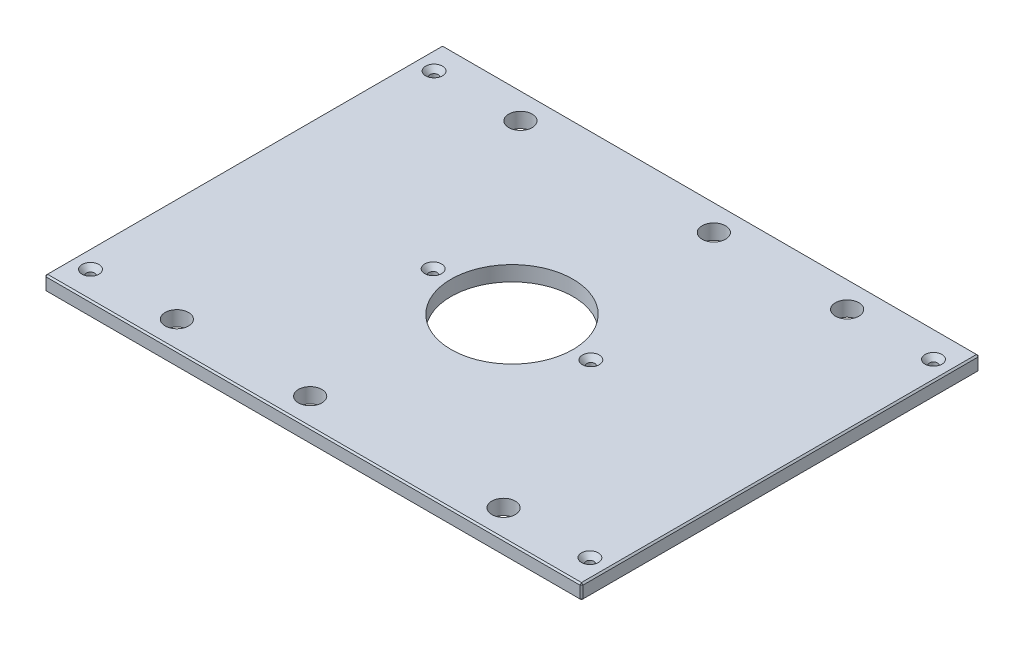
from build123d import *

# Parameters (mm, degrees)
SKETCH1_W                                        = 454.025
SKETCH1_H                                        = 336.55
BOSS_EXTRUDE1_DEPTH                              = 12.7
SKETCH13_R                                       = 51.562
CUT_EXTRUDE6_DEPTH                               = 283.864704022
F_25_32_0_78125_DIAMETER_HOLE1_D                 = 19.84375
CHAMFER2_SIZE                                    = 1.27
CSK_FOR_1_4_FLAT_HEAD_MACHINE_SCREW1_D           = 6.7564
CSK_FOR_1_4_FLAT_HEAD_MACHINE_SCREW1_CSINK_D     = 14.2748
CSK_FOR_1_4_FLAT_HEAD_MACHINE_SCREW1_CSINK_ANGLE = 82


with BuildPart() as part:
    # Sketch1 → Boss-Extrude1 (new body)
    with BuildSketch(Plane(origin=(0, 0, 0), x_dir=(1, 0, 0), z_dir=(0, 1, 0))):
        Rectangle(SKETCH1_W, SKETCH1_H)
    extrude(amount=BOSS_EXTRUDE1_DEPTH)

    # Sketch13 → Cut-Extrude6 (cut, through all)
    with BuildSketch(Plane(origin=(0, 12.7, 0), x_dir=(1, 0, 0), z_dir=(0, 1, 0))):
        with Locations(Location((0, 0, 0), (0, 0, 270))):
            Circle(SKETCH13_R)
    extrude(amount=-CUT_EXTRUDE6_DEPTH, mode=Mode.SUBTRACT)

    # 25_32 _0.78125_ Diameter Hole1 (through all)
    with Locations(Plane(origin=(0, 12.7, 0), x_dir=(1, 0, 0), z_dir=(0, 1, 0))):
        with Locations((138.1125, 145.25498), (-138.1125, 145.25498), (138.1125, -145.25498), (-138.1125, -145.25498), (25.4, 145.25498), (-25.4, -145.25498)):
            Hole(F_25_32_0_78125_DIAMETER_HOLE1_D / 2)

    # Chamfer2
    chamfer2_edges = [part.edges().sort_by_distance(p)[0] for p in [
        (227.0125, 12.7, 0),
        (0, 12.7, -168.275),
        (-227.0125, 12.7, 0),
        (0, 0, -168.275),
        (227.0125, 0, 0),
        (0, 0, 168.275),
        (-227.0125, 0, 0),
        (0, 12.7, 168.275),
        (-227.0125, 6.35, -168.275),
        (227.0125, 6.35, -168.275),
        (227.0125, 6.35, 168.275),
        (-227.0125, 6.35, 168.275),
    ]]
    chamfer(chamfer2_edges, length=CHAMFER2_SIZE)

    # CSK for 1_4 Flat Head Machine Screw1 (through all)
    with Locations(Plane(origin=(0, 12.7, 0), x_dir=(1, 0, 0), z_dir=(0, 1, 0))):
        with Locations((211.1375, 145.25498), (211.1375, -145.25498), (-211.1375, -145.25498), (-66.675, 0), (66.675, 0), (-211.1375, 145.25498), (-138.1125, 145.25498), (-138.1125, -145.25498)):
            CounterSinkHole(CSK_FOR_1_4_FLAT_HEAD_MACHINE_SCREW1_D / 2, CSK_FOR_1_4_FLAT_HEAD_MACHINE_SCREW1_CSINK_D / 2, counter_sink_angle=CSK_FOR_1_4_FLAT_HEAD_MACHINE_SCREW1_CSINK_ANGLE)


solid = part.part
